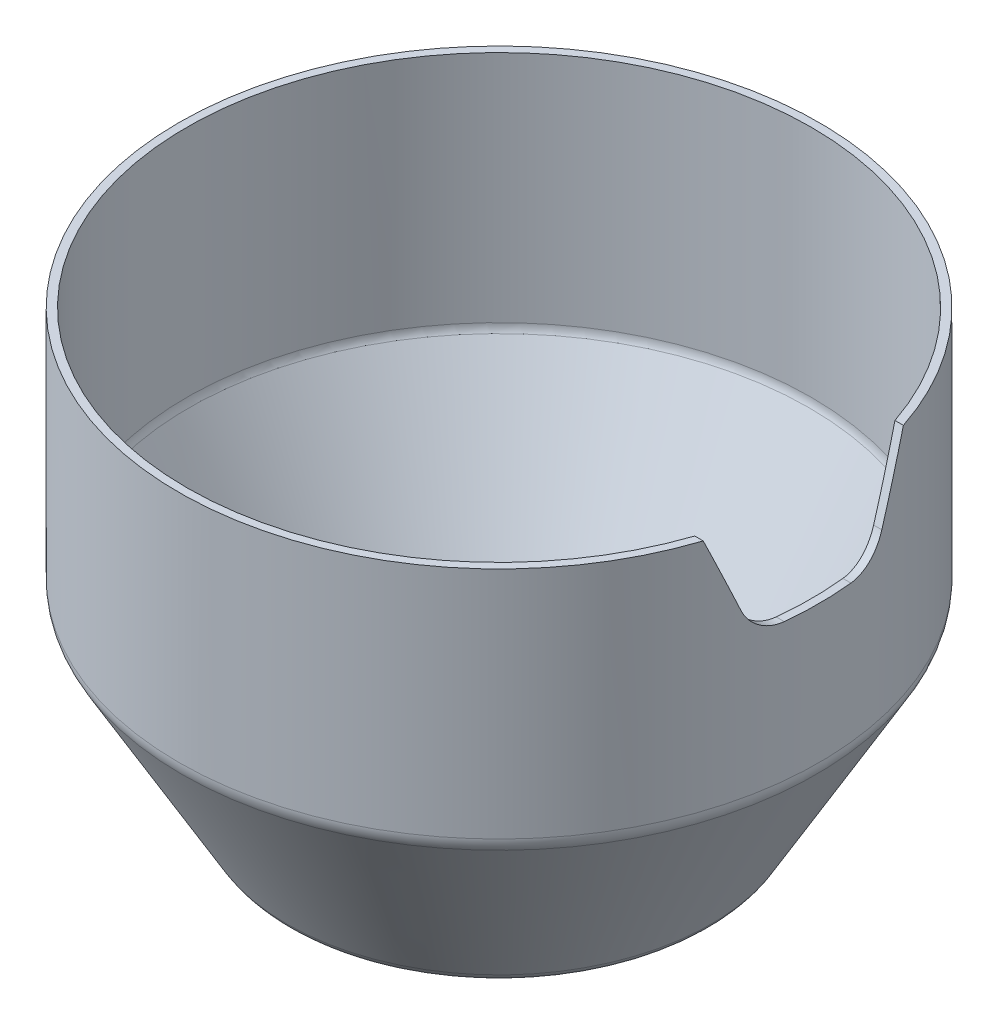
from build123d import *

# Parameters (mm, degrees)
CONG_1_R                = 3
CONG_2_R                = 2
ESQUISSE2_R             = 11
ESQUISSE2_R_2           = 3
ENL_V_MAT_EXTRU_1_DEPTH = 79.898669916
ENL_V_MAT_EXTRU_2_DEPTH = 79.898669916
CONG_3_R                = 5


with BuildPart() as part:
    # Esquisse1 → R_volution1 (revolve)
    with BuildSketch(Plane.XY, mode=Mode.PRIVATE) as r_volution1_sk:
        Polygon((0, 0), (25.577350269, 0), (40, 24.980762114), (40, 55), (39, 55), (39, 25.248711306), (25, 1), (0, 1), align=None)
    revolve(r_volution1_sk.sketch.rotate(Axis((0, 0, 0), (0, 1, 0)), 90), axis=Axis((0, 0, 0), (0, 1, 0)))

    # Cong_1
    cong_1_edges = [part.edges().sort_by_distance(p)[0] for p in [
        (0, 24.980762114, 40),
        (0, 0, 25.577350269),
    ]]
    fillet(cong_1_edges, radius=CONG_1_R)

    # Cong_2
    cong_2_edges = [part.edges().sort_by_distance(p)[0] for p in [
        (0, 1, 25),
        (0, 25.248711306, 39),
    ]]
    fillet(cong_2_edges, radius=CONG_2_R)

    # Esquisse2 → Enl_v. mat.-Extru.1 (cut, through all)
    with BuildSketch(Plane.XZ):
        with Locations(Location((0, 0, 0), (0, 0, 270))):
            Circle(ESQUISSE2_R)
        with Locations(Location((0, 18, 0), (0, 0, 270))):
            Circle(ESQUISSE2_R_2)
        with Locations(Location((0, -18, 0), (0, 0, 270))):
            Circle(ESQUISSE2_R_2)
    extrude(amount=-ENL_V_MAT_EXTRU_1_DEPTH, mode=Mode.SUBTRACT)

    # Esquisse3 → Enl_v. mat.-Extru.2 (cut, through all)
    with BuildSketch(Plane(origin=(0, 0, 0), x_dir=(0, 0, -1), z_dir=(1, 0, 0))):
        Polygon((-12.5, 55), (-7.5, 43), (7.5, 43), (12.5, 55), align=None)
    extrude(amount=ENL_V_MAT_EXTRU_2_DEPTH, mode=Mode.SUBTRACT)

    # Cong_3
    cong_3_edges = [part.edges().sort_by_distance(p)[0] for p in [
        (38.78131829, 43, -7.5),
        (38.78131829, 43, 7.5),
    ]]
    fillet(cong_3_edges, radius=CONG_3_R)


solid = part.part
